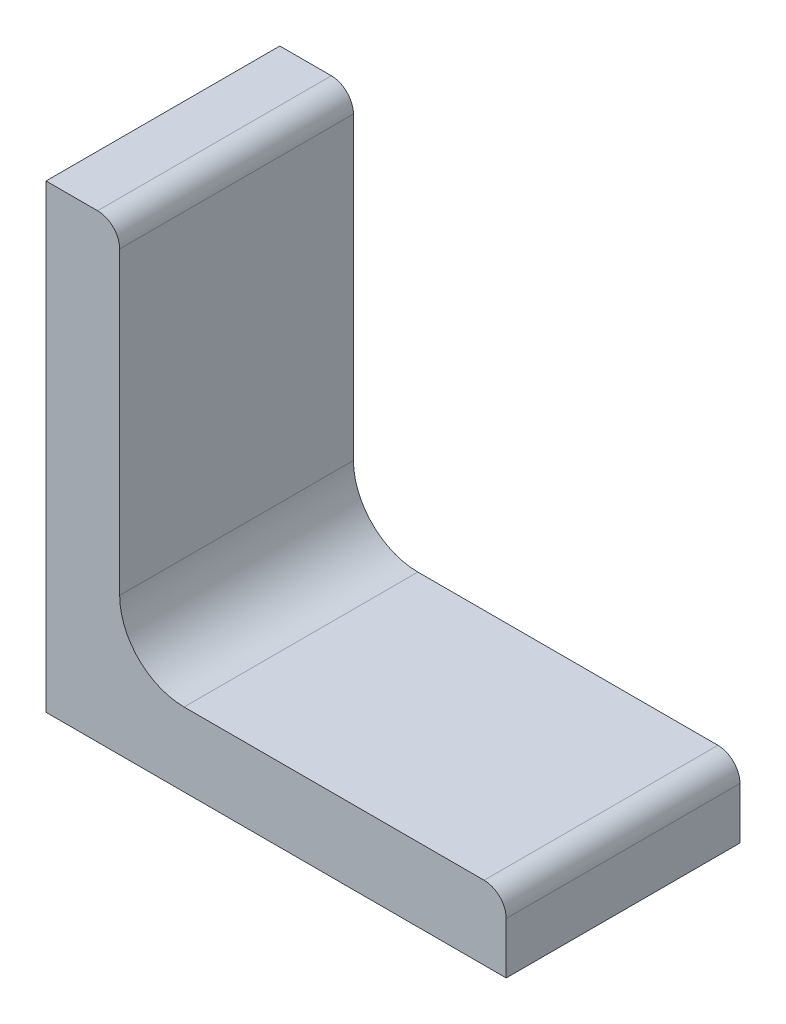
from build123d import *

# Parameters (mm, degrees)
BASESECTION_DEPTH = 12.7


with BuildPart() as part:
    # Sketch1 → BaseSection (new, symmetric)
    with BuildSketch(Plane.XY):
        with BuildLine():
            Line((0, 0), (50, 0))
            Line((50, 0), (50, 5.6))
            ThreePointArc((50, 5.6), (49.297056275, 7.297056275), (47.6, 8))
            Line((47.6, 8), (15, 8))
            ThreePointArc((15, 8), (10.050252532, 10.050252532), (8, 15))
            Line((8, 15), (8, 47.6))
            ThreePointArc((8, 47.6), (7.297056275, 49.297056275), (5.6, 50))
            Line((5.6, 50), (0, 50))
            Line((0, 50), (0, 0))
        make_face()
    extrude(amount=BASESECTION_DEPTH, both=True)


solid = part.part
